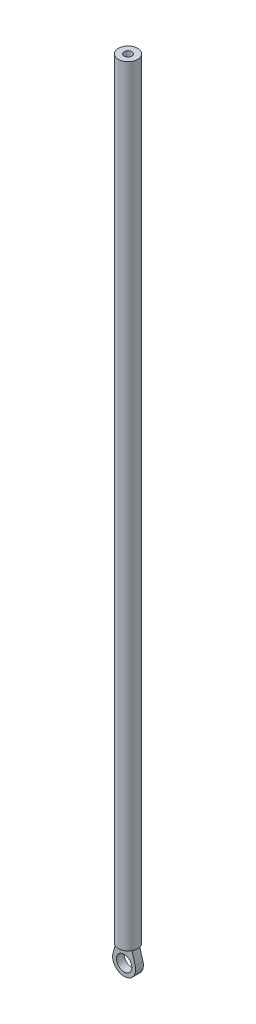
ISO-10303-21;
HEADER;
FILE_DESCRIPTION(('STEP AP214'),'2;1');
FILE_NAME('part.step','',(''),(''),'','','');
FILE_SCHEMA(('AUTOMOTIVE_DESIGN { 1 0 10303 214 1 1 1 1 }'));
ENDSEC;
DATA;
#1=APPLICATION_CONTEXT('core data for automotive mechanical design processes');
#2=APPLICATION_PROTOCOL_DEFINITION('international standard','automotive_design',2000,#1);
#3=PRODUCT_CONTEXT('',#1,'mechanical');
#4=PRODUCT('Part','Part','',(#3));
#5=PRODUCT_RELATED_PRODUCT_CATEGORY('part','',(#4));
#6=PRODUCT_DEFINITION_FORMATION('','',#4);
#7=PRODUCT_DEFINITION_CONTEXT('part definition',#1,'design');
#8=PRODUCT_DEFINITION('design','',#6,#7);
#9=PRODUCT_DEFINITION_SHAPE('','',#8);
#10=(LENGTH_UNIT() NAMED_UNIT(*) SI_UNIT(.MILLI.,.METRE.));
#11=(NAMED_UNIT(*) PLANE_ANGLE_UNIT() SI_UNIT($,.RADIAN.));
#12=(NAMED_UNIT(*) SI_UNIT($,.STERADIAN.) SOLID_ANGLE_UNIT());
#13=UNCERTAINTY_MEASURE_WITH_UNIT(LENGTH_MEASURE(1.E-05),#10,'distance_accuracy_value','');
#14=(GEOMETRIC_REPRESENTATION_CONTEXT(3) GLOBAL_UNCERTAINTY_ASSIGNED_CONTEXT((#13)) GLOBAL_UNIT_ASSIGNED_CONTEXT((#10,
#11,#12)) REPRESENTATION_CONTEXT('',''));
#15=CARTESIAN_POINT('',(0.,0.,0.));
#16=DIRECTION('',(0.,0.,1.));
#17=DIRECTION('',(1.,0.,0.));
#18=AXIS2_PLACEMENT_3D('',#15,#16,#17);
#19=CARTESIAN_POINT('',(-14.4498743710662,4.02506281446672,5.));
#20=DIRECTION('',(0.963324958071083,-0.268337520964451,0.));
#21=DIRECTION('',(0.268337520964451,0.963324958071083,0.));
#22=AXIS2_PLACEMENT_3D('',#19,#20,#21);
#23=PLANE('',#22);
#24=DIRECTION('',(-0.268337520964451,-0.963324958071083,0.));
#25=VECTOR('',#24,1.);
#26=CARTESIAN_POINT('',(-14.4498743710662,4.02506281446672,-5.));
#27=LINE('',#26,#25);
#28=CARTESIAN_POINT('',(-10.,20.,-5.));
#29=VERTEX_POINT('',#28);
#30=CARTESIAN_POINT('',(-14.4498743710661,4.02506281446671,-5.));
#31=VERTEX_POINT('',#30);
#32=EDGE_CURVE('E92',#29,#31,#27,.T.);
#33=ORIENTED_EDGE('',*,*,#32,.T.);
#34=DIRECTION('',(0.,0.,-1.));
#35=VECTOR('',#34,1.);
#36=CARTESIAN_POINT('',(-14.4498743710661,4.02506281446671,5.));
#37=LINE('',#36,#35);
#38=CARTESIAN_POINT('',(-14.4498743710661,4.02506281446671,5.));
#39=VERTEX_POINT('',#38);
#40=EDGE_CURVE('E11',#39,#31,#37,.T.);
#41=ORIENTED_EDGE('',*,*,#40,.F.);
#42=DIRECTION('',(-0.268337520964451,-0.963324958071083,0.));
#43=VECTOR('',#42,1.);
#44=CARTESIAN_POINT('',(-14.4498743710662,4.02506281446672,5.));
#45=LINE('',#44,#43);
#46=CARTESIAN_POINT('',(-10.,20.,5.));
#47=VERTEX_POINT('',#46);
#48=EDGE_CURVE('E56',#47,#39,#45,.T.);
#49=ORIENTED_EDGE('',*,*,#48,.F.);
#50=DIRECTION('',(0.,0.,-1.));
#51=VECTOR('',#50,1.);
#52=CARTESIAN_POINT('',(-10.,20.,5.));
#53=LINE('',#52,#51);
#54=EDGE_CURVE('E76',#47,#29,#53,.T.);
#55=ORIENTED_EDGE('',*,*,#54,.T.);
#56=EDGE_LOOP('',(#33,#41,#49,#55));
#57=FACE_BOUND('',#56,.T.);
#58=ADVANCED_FACE('F39',(#57),#23,.F.);
#59=CARTESIAN_POINT('',(0.,0.,5.));
#60=DIRECTION('',(0.,0.,-1.));
#61=DIRECTION('',(-1.,0.,0.));
#62=AXIS2_PLACEMENT_3D('',#59,#60,#61);
#63=CYLINDRICAL_SURFACE('',#62,14.9999999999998);
#64=CARTESIAN_POINT('',(0.,0.,-5.));
#65=DIRECTION('',(0.,0.,1.));
#66=DIRECTION('',(1.,0.,0.));
#67=AXIS2_PLACEMENT_3D('',#64,#65,#66);
#68=CIRCLE('',#67,14.9999999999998);
#69=CARTESIAN_POINT('',(14.4498743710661,4.02506281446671,-5.));
#70=VERTEX_POINT('',#69);
#71=EDGE_CURVE('E100',#31,#70,#68,.T.);
#72=ORIENTED_EDGE('',*,*,#71,.T.);
#73=DIRECTION('',(0.,0.,-1.));
#74=VECTOR('',#73,1.);
#75=CARTESIAN_POINT('',(14.4498743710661,4.02506281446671,5.));
#76=LINE('',#75,#74);
#77=CARTESIAN_POINT('',(14.4498743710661,4.02506281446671,5.));
#78=VERTEX_POINT('',#77);
#79=EDGE_CURVE('E48',#78,#70,#76,.T.);
#80=ORIENTED_EDGE('',*,*,#79,.F.);
#81=CARTESIAN_POINT('',(0.,0.,5.));
#82=DIRECTION('',(0.,0.,1.));
#83=DIRECTION('',(1.,0.,0.));
#84=AXIS2_PLACEMENT_3D('',#81,#82,#83);
#85=CIRCLE('',#84,14.9999999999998);
#86=EDGE_CURVE('E82',#39,#78,#85,.T.);
#87=ORIENTED_EDGE('',*,*,#86,.F.);
#88=ORIENTED_EDGE('',*,*,#40,.T.);
#89=EDGE_LOOP('',(#72,#80,#87,#88));
#90=FACE_BOUND('',#89,.T.);
#91=ADVANCED_FACE('F151',(#90),#63,.T.);
#92=CARTESIAN_POINT('',(14.4498743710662,4.02506281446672,5.));
#93=DIRECTION('',(0.963324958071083,0.268337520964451,0.));
#94=DIRECTION('',(-0.268337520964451,0.963324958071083,0.));
#95=AXIS2_PLACEMENT_3D('',#92,#93,#94);
#96=PLANE('',#95);
#97=DIRECTION('',(0.268337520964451,-0.963324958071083,0.));
#98=VECTOR('',#97,1.);
#99=CARTESIAN_POINT('',(14.4498743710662,4.02506281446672,-5.));
#100=LINE('',#99,#98);
#101=CARTESIAN_POINT('',(10.,20.,-5.));
#102=VERTEX_POINT('',#101);
#103=EDGE_CURVE('E91',#102,#70,#100,.T.);
#104=ORIENTED_EDGE('',*,*,#103,.F.);
#105=DIRECTION('',(0.,0.,-1.));
#106=VECTOR('',#105,1.);
#107=CARTESIAN_POINT('',(10.,20.,5.));
#108=LINE('',#107,#106);
#109=CARTESIAN_POINT('',(10.,20.,5.));
#110=VERTEX_POINT('',#109);
#111=EDGE_CURVE('E98',#110,#102,#108,.T.);
#112=ORIENTED_EDGE('',*,*,#111,.F.);
#113=DIRECTION('',(0.268337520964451,-0.963324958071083,0.));
#114=VECTOR('',#113,1.);
#115=CARTESIAN_POINT('',(14.4498743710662,4.02506281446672,5.));
#116=LINE('',#115,#114);
#117=EDGE_CURVE('E119',#110,#78,#116,.T.);
#118=ORIENTED_EDGE('',*,*,#117,.T.);
#119=ORIENTED_EDGE('',*,*,#79,.T.);
#120=EDGE_LOOP('',(#104,#112,#118,#119));
#121=FACE_BOUND('',#120,.T.);
#122=ADVANCED_FACE('F97',(#121),#96,.T.);
#123=CARTESIAN_POINT('',(0.,0.,5.));
#124=DIRECTION('',(0.,0.,-1.));
#125=DIRECTION('',(-1.,0.,0.));
#126=AXIS2_PLACEMENT_3D('',#123,#124,#125);
#127=CYLINDRICAL_SURFACE('',#126,9.99999999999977);
#128=CARTESIAN_POINT('',(0.,0.,5.));
#129=DIRECTION('',(0.,0.,1.));
#130=DIRECTION('',(1.,0.,0.));
#131=AXIS2_PLACEMENT_3D('',#128,#129,#130);
#132=CIRCLE('',#131,9.99999999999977);
#133=CARTESIAN_POINT('',(9.99999999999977,0.,5.));
#134=VERTEX_POINT('',#133);
#135=EDGE_CURVE('E108',#134,#134,#132,.T.);
#136=ORIENTED_EDGE('',*,*,#135,.T.);
#137=EDGE_LOOP('',(#136));
#138=FACE_BOUND('',#137,.T.);
#139=CARTESIAN_POINT('',(0.,0.,-5.));
#140=DIRECTION('',(0.,0.,1.));
#141=DIRECTION('',(1.,0.,0.));
#142=AXIS2_PLACEMENT_3D('',#139,#140,#141);
#143=CIRCLE('',#142,9.99999999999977);
#144=CARTESIAN_POINT('',(9.99999999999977,0.,-5.));
#145=VERTEX_POINT('',#144);
#146=EDGE_CURVE('E95',#145,#145,#143,.T.);
#147=ORIENTED_EDGE('',*,*,#146,.F.);
#148=EDGE_LOOP('',(#147));
#149=FACE_BOUND('',#148,.T.);
#150=ADVANCED_FACE('F159',(#138,#149),#127,.F.);
#151=CARTESIAN_POINT('',(0.,0.,5.));
#152=DIRECTION('',(0.,0.,1.));
#153=DIRECTION('',(1.,0.,0.));
#154=AXIS2_PLACEMENT_3D('',#151,#152,#153);
#155=PLANE('',#154);
#156=ORIENTED_EDGE('',*,*,#48,.T.);
#157=ORIENTED_EDGE('',*,*,#86,.T.);
#158=ORIENTED_EDGE('',*,*,#117,.F.);
#159=DIRECTION('',(1.,0.,0.));
#160=VECTOR('',#159,1.);
#161=CARTESIAN_POINT('',(0.,20.,5.));
#162=LINE('',#161,#160);
#163=EDGE_CURVE('E105',#47,#110,#162,.T.);
#164=ORIENTED_EDGE('',*,*,#163,.F.);
#165=EDGE_LOOP('',(#156,#157,#158,#164));
#166=FACE_BOUND('',#165,.T.);
#167=ORIENTED_EDGE('',*,*,#135,.F.);
#168=EDGE_LOOP('',(#167));
#169=FACE_BOUND('',#168,.T.);
#170=ADVANCED_FACE('F156',(#166,#169),#155,.T.);
#171=CARTESIAN_POINT('',(0.,0.,-5.));
#172=DIRECTION('',(0.,0.,1.));
#173=DIRECTION('',(1.,0.,0.));
#174=AXIS2_PLACEMENT_3D('',#171,#172,#173);
#175=PLANE('',#174);
#176=ORIENTED_EDGE('',*,*,#32,.F.);
#177=DIRECTION('',(1.,0.,0.));
#178=VECTOR('',#177,1.);
#179=CARTESIAN_POINT('',(0.,20.,-5.));
#180=LINE('',#179,#178);
#181=EDGE_CURVE('E88',#29,#102,#180,.T.);
#182=ORIENTED_EDGE('',*,*,#181,.T.);
#183=ORIENTED_EDGE('',*,*,#103,.T.);
#184=ORIENTED_EDGE('',*,*,#71,.F.);
#185=EDGE_LOOP('',(#176,#182,#183,#184));
#186=FACE_BOUND('',#185,.T.);
#187=ORIENTED_EDGE('',*,*,#146,.T.);
#188=EDGE_LOOP('',(#187));
#189=FACE_BOUND('',#188,.T.);
#190=ADVANCED_FACE('F89',(#186,#189),#175,.F.);
#191=CARTESIAN_POINT('',(0.,1020.,0.));
#192=DIRECTION('',(0.,-1.,0.));
#193=DIRECTION('',(0.,0.,-1.));
#194=AXIS2_PLACEMENT_3D('',#191,#192,#193);
#195=CYLINDRICAL_SURFACE('',#194,12.5);
#196=CARTESIAN_POINT('',(0.,1020.,0.));
#197=DIRECTION('',(0.,1.,0.));
#198=DIRECTION('',(0.,0.,1.));
#199=AXIS2_PLACEMENT_3D('',#196,#197,#198);
#200=CIRCLE('',#199,12.5);
#201=CARTESIAN_POINT('',(0.,1020.,12.5));
#202=VERTEX_POINT('',#201);
#203=EDGE_CURVE('E115',#202,#202,#200,.T.);
#204=ORIENTED_EDGE('',*,*,#203,.F.);
#205=EDGE_LOOP('',(#204));
#206=FACE_BOUND('',#205,.T.);
#207=CARTESIAN_POINT('',(0.,20.,0.));
#208=DIRECTION('',(0.,1.,0.));
#209=DIRECTION('',(0.,0.,1.));
#210=AXIS2_PLACEMENT_3D('',#207,#208,#209);
#211=CIRCLE('',#210,12.5);
#212=CARTESIAN_POINT('',(0.,20.,12.5));
#213=VERTEX_POINT('',#212);
#214=EDGE_CURVE('E123',#213,#213,#211,.T.);
#215=ORIENTED_EDGE('',*,*,#214,.T.);
#216=EDGE_LOOP('',(#215));
#217=FACE_BOUND('',#216,.T.);
#218=ADVANCED_FACE('F168',(#206,#217),#195,.T.);
#219=CARTESIAN_POINT('',(0.,1020.,0.));
#220=DIRECTION('',(0.,1.,0.));
#221=DIRECTION('',(0.,0.,1.));
#222=AXIS2_PLACEMENT_3D('',#219,#220,#221);
#223=PLANE('',#222);
#224=CARTESIAN_POINT('',(0.,1020.,0.));
#225=DIRECTION('',(0.,1.,0.));
#226=DIRECTION('',(0.,0.,1.));
#227=AXIS2_PLACEMENT_3D('',#224,#225,#226);
#228=CIRCLE('',#227,5.);
#229=CARTESIAN_POINT('',(0.,1020.,5.));
#230=VERTEX_POINT('',#229);
#231=EDGE_CURVE('E42',#230,#230,#228,.F.);
#232=ORIENTED_EDGE('',*,*,#231,.T.);
#233=EDGE_LOOP('',(#232));
#234=FACE_BOUND('',#233,.T.);
#235=ORIENTED_EDGE('',*,*,#203,.T.);
#236=EDGE_LOOP('',(#235));
#237=FACE_BOUND('',#236,.T.);
#238=ADVANCED_FACE('F135',(#234,#237),#223,.T.);
#239=CARTESIAN_POINT('',(0.,20.,0.));
#240=DIRECTION('',(0.,1.,0.));
#241=DIRECTION('',(0.,0.,1.));
#242=AXIS2_PLACEMENT_3D('',#239,#240,#241);
#243=PLANE('',#242);
#244=ORIENTED_EDGE('',*,*,#181,.F.);
#245=ORIENTED_EDGE('',*,*,#54,.F.);
#246=ORIENTED_EDGE('',*,*,#163,.T.);
#247=ORIENTED_EDGE('',*,*,#111,.T.);
#248=EDGE_LOOP('',(#244,#245,#246,#247));
#249=FACE_BOUND('',#248,.T.);
#250=ORIENTED_EDGE('',*,*,#214,.F.);
#251=EDGE_LOOP('',(#250));
#252=FACE_BOUND('',#251,.T.);
#253=ADVANCED_FACE('F103',(#249,#252),#243,.F.);
#254=CARTESIAN_POINT('',(0.,1220.,0.));
#255=DIRECTION('',(0.,-1.,0.));
#256=DIRECTION('',(0.,0.,-1.));
#257=AXIS2_PLACEMENT_3D('',#254,#255,#256);
#258=CYLINDRICAL_SURFACE('',#257,5.);
#259=ORIENTED_EDGE('',*,*,#231,.F.);
#260=EDGE_LOOP('',(#259));
#261=FACE_BOUND('',#260,.T.);
#262=CARTESIAN_POINT('',(0.,220.,0.));
#263=DIRECTION('',(0.,1.,0.));
#264=DIRECTION('',(0.,0.,1.));
#265=AXIS2_PLACEMENT_3D('',#262,#263,#264);
#266=CIRCLE('',#265,5.);
#267=CARTESIAN_POINT('',(0.,220.,5.));
#268=VERTEX_POINT('',#267);
#269=EDGE_CURVE('E128',#268,#268,#266,.T.);
#270=ORIENTED_EDGE('',*,*,#269,.F.);
#271=EDGE_LOOP('',(#270));
#272=FACE_BOUND('',#271,.T.);
#273=ADVANCED_FACE('F138',(#261,#272),#258,.F.);
#274=CARTESIAN_POINT('',(0.,220.,0.));
#275=DIRECTION('',(0.,1.,0.));
#276=DIRECTION('',(0.,0.,1.));
#277=AXIS2_PLACEMENT_3D('',#274,#275,#276);
#278=PLANE('',#277);
#279=ORIENTED_EDGE('',*,*,#269,.T.);
#280=EDGE_LOOP('',(#279));
#281=FACE_BOUND('',#280,.T.);
#282=ADVANCED_FACE('F141',(#281),#278,.T.);
#283=CLOSED_SHELL('',(#58,#91,#122,#150,#170,#190,#218,#238,#253,#273,#282));
#284=MANIFOLD_SOLID_BREP('B2',#283);
#285=ADVANCED_BREP_SHAPE_REPRESENTATION('',(#18,#284),#14);
#286=SHAPE_DEFINITION_REPRESENTATION(#9,#285);
ENDSEC;
END-ISO-10303-21;
